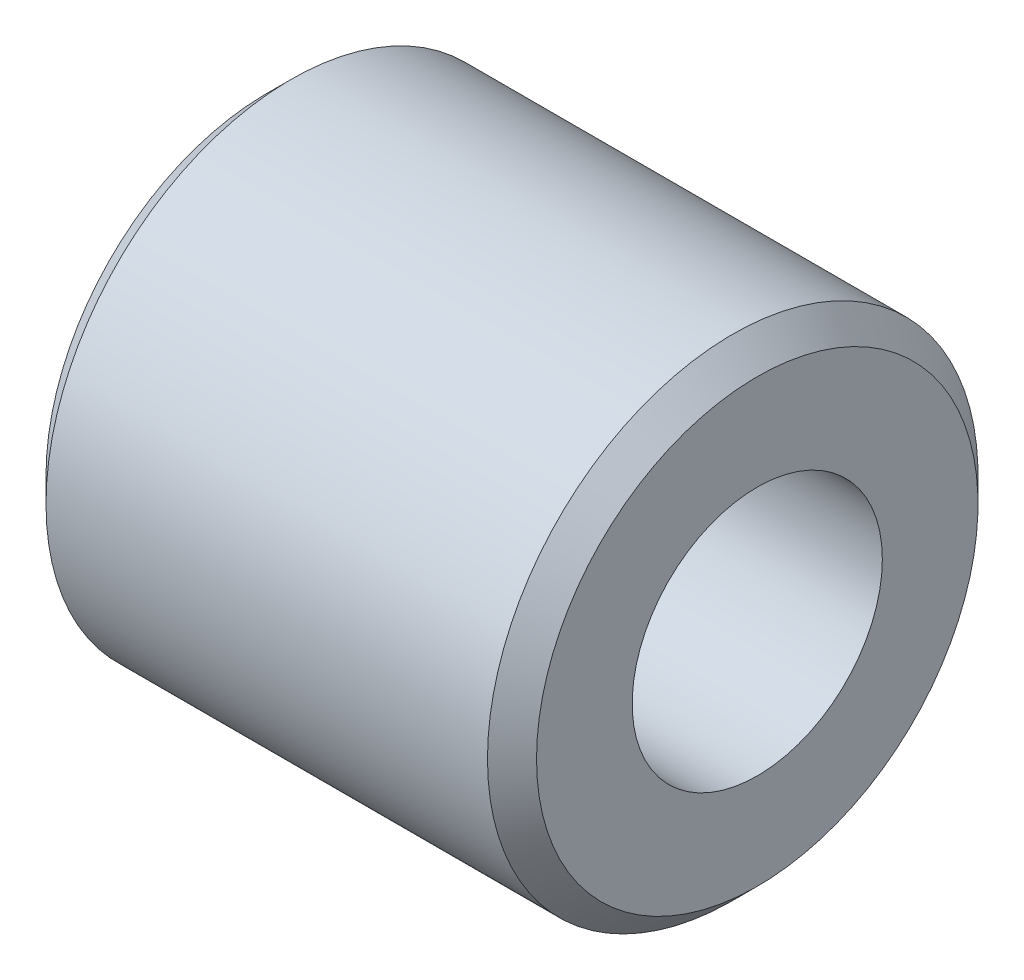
ISO-10303-21;
HEADER;
FILE_DESCRIPTION(('STEP AP214'),'2;1');
FILE_NAME('part.step','',(''),(''),'','','');
FILE_SCHEMA(('AUTOMOTIVE_DESIGN { 1 0 10303 214 1 1 1 1 }'));
ENDSEC;
DATA;
#1=APPLICATION_CONTEXT('core data for automotive mechanical design processes');
#2=APPLICATION_PROTOCOL_DEFINITION('international standard','automotive_design',2000,#1);
#3=PRODUCT_CONTEXT('',#1,'mechanical');
#4=PRODUCT('Part','Part','',(#3));
#5=PRODUCT_RELATED_PRODUCT_CATEGORY('part','',(#4));
#6=PRODUCT_DEFINITION_FORMATION('','',#4);
#7=PRODUCT_DEFINITION_CONTEXT('part definition',#1,'design');
#8=PRODUCT_DEFINITION('design','',#6,#7);
#9=PRODUCT_DEFINITION_SHAPE('','',#8);
#10=(LENGTH_UNIT() NAMED_UNIT(*) SI_UNIT(.MILLI.,.METRE.));
#11=(NAMED_UNIT(*) PLANE_ANGLE_UNIT() SI_UNIT($,.RADIAN.));
#12=(NAMED_UNIT(*) SI_UNIT($,.STERADIAN.) SOLID_ANGLE_UNIT());
#13=UNCERTAINTY_MEASURE_WITH_UNIT(LENGTH_MEASURE(1.E-05),#10,'distance_accuracy_value','');
#14=(GEOMETRIC_REPRESENTATION_CONTEXT(3) GLOBAL_UNCERTAINTY_ASSIGNED_CONTEXT((#13)) GLOBAL_UNIT_ASSIGNED_CONTEXT((#10,
#11,#12)) REPRESENTATION_CONTEXT('',''));
#15=CARTESIAN_POINT('',(0.,0.,0.));
#16=DIRECTION('',(0.,0.,1.));
#17=DIRECTION('',(1.,0.,0.));
#18=AXIS2_PLACEMENT_3D('',#15,#16,#17);
#19=CARTESIAN_POINT('',(0.,9.00000000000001,0.));
#20=DIRECTION('',(-1.,0.,0.));
#21=DIRECTION('',(0.,0.,1.));
#22=AXIS2_PLACEMENT_3D('',#19,#20,#21);
#23=PLANE('',#22);
#24=CARTESIAN_POINT('',(0.,0.,0.));
#25=DIRECTION('',(1.,0.,0.));
#26=DIRECTION('',(0.,0.,-1.));
#27=AXIS2_PLACEMENT_3D('',#24,#25,#26);
#28=CIRCLE('',#27,5.09999999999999);
#29=CARTESIAN_POINT('',(0.,0.,-5.09999999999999));
#30=VERTEX_POINT('',#29);
#31=EDGE_CURVE('E53',#30,#30,#28,.T.);
#32=ORIENTED_EDGE('',*,*,#31,.F.);
#33=EDGE_LOOP('',(#32));
#34=FACE_BOUND('',#33,.T.);
#35=CARTESIAN_POINT('',(0.,0.,0.));
#36=DIRECTION('',(-1.,0.,0.));
#37=DIRECTION('',(0.,0.,1.));
#38=AXIS2_PLACEMENT_3D('',#35,#36,#37);
#39=CIRCLE('',#38,9.00000000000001);
#40=CARTESIAN_POINT('',(0.,0.,9.00000000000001));
#41=VERTEX_POINT('',#40);
#42=EDGE_CURVE('E48',#41,#41,#39,.T.);
#43=ORIENTED_EDGE('',*,*,#42,.F.);
#44=EDGE_LOOP('',(#43));
#45=FACE_BOUND('',#44,.T.);
#46=ADVANCED_FACE('F34',(#34,#45),#23,.F.);
#47=CARTESIAN_POINT('',(-20.,0.,0.));
#48=DIRECTION('',(1.,0.,0.));
#49=DIRECTION('',(0.,0.,-1.));
#50=AXIS2_PLACEMENT_3D('',#47,#48,#49);
#51=PLANE('',#50);
#52=CARTESIAN_POINT('',(-20.,0.,0.));
#53=DIRECTION('',(1.,0.,0.));
#54=DIRECTION('',(0.,0.,-1.));
#55=AXIS2_PLACEMENT_3D('',#52,#53,#54);
#56=CIRCLE('',#55,5.09999999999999);
#57=CARTESIAN_POINT('',(-20.,0.,-5.09999999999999));
#58=VERTEX_POINT('',#57);
#59=EDGE_CURVE('E56',#58,#58,#56,.T.);
#60=ORIENTED_EDGE('',*,*,#59,.T.);
#61=EDGE_LOOP('',(#60));
#62=FACE_BOUND('',#61,.T.);
#63=CARTESIAN_POINT('',(-20.,0.,0.));
#64=DIRECTION('',(-1.,0.,0.));
#65=DIRECTION('',(0.,0.,1.));
#66=AXIS2_PLACEMENT_3D('',#63,#64,#65);
#67=CIRCLE('',#66,9.00000000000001);
#68=CARTESIAN_POINT('',(-20.,0.,9.00000000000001));
#69=VERTEX_POINT('',#68);
#70=EDGE_CURVE('E10',#69,#69,#67,.T.);
#71=ORIENTED_EDGE('',*,*,#70,.T.);
#72=EDGE_LOOP('',(#71));
#73=FACE_BOUND('',#72,.T.);
#74=ADVANCED_FACE('F60',(#62,#73),#51,.F.);
#75=CARTESIAN_POINT('',(-19.,0.,0.));
#76=DIRECTION('',(1.,0.,0.));
#77=DIRECTION('',(0.,0.,-1.));
#78=AXIS2_PLACEMENT_3D('',#75,#76,#77);
#79=CONICAL_SURFACE('',#78,10.,0.785398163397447);
#80=ORIENTED_EDGE('',*,*,#70,.F.);
#81=EDGE_LOOP('',(#80));
#82=FACE_BOUND('',#81,.T.);
#83=CARTESIAN_POINT('',(-19.,0.,0.));
#84=DIRECTION('',(-1.,0.,0.));
#85=DIRECTION('',(0.,0.,1.));
#86=AXIS2_PLACEMENT_3D('',#83,#84,#85);
#87=CIRCLE('',#86,10.);
#88=CARTESIAN_POINT('',(-19.,0.,10.));
#89=VERTEX_POINT('',#88);
#90=EDGE_CURVE('E40',#89,#89,#87,.T.);
#91=ORIENTED_EDGE('',*,*,#90,.T.);
#92=EDGE_LOOP('',(#91));
#93=FACE_BOUND('',#92,.T.);
#94=ADVANCED_FACE('F80',(#82,#93),#79,.T.);
#95=CARTESIAN_POINT('',(-22.0390516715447,0.,0.));
#96=DIRECTION('',(-1.,0.,0.));
#97=DIRECTION('',(0.,0.,1.));
#98=AXIS2_PLACEMENT_3D('',#95,#96,#97);
#99=CYLINDRICAL_SURFACE('',#98,10.);
#100=ORIENTED_EDGE('',*,*,#90,.F.);
#101=EDGE_LOOP('',(#100));
#102=FACE_BOUND('',#101,.T.);
#103=CARTESIAN_POINT('',(-1.,0.,0.));
#104=DIRECTION('',(-1.,0.,0.));
#105=DIRECTION('',(0.,0.,1.));
#106=AXIS2_PLACEMENT_3D('',#103,#104,#105);
#107=CIRCLE('',#106,10.);
#108=CARTESIAN_POINT('',(-1.,0.,10.));
#109=VERTEX_POINT('',#108);
#110=EDGE_CURVE('E44',#109,#109,#107,.T.);
#111=ORIENTED_EDGE('',*,*,#110,.T.);
#112=EDGE_LOOP('',(#111));
#113=FACE_BOUND('',#112,.T.);
#114=ADVANCED_FACE('F74',(#102,#113),#99,.T.);
#115=CARTESIAN_POINT('',(0.,0.,0.));
#116=DIRECTION('',(-1.,0.,0.));
#117=DIRECTION('',(0.,0.,1.));
#118=AXIS2_PLACEMENT_3D('',#115,#116,#117);
#119=CONICAL_SURFACE('',#118,9.00000000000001,0.785398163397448);
#120=ORIENTED_EDGE('',*,*,#110,.F.);
#121=EDGE_LOOP('',(#120));
#122=FACE_BOUND('',#121,.T.);
#123=ORIENTED_EDGE('',*,*,#42,.T.);
#124=EDGE_LOOP('',(#123));
#125=FACE_BOUND('',#124,.T.);
#126=ADVANCED_FACE('F65',(#122,#125),#119,.T.);
#127=CARTESIAN_POINT('',(0.,0.,0.));
#128=DIRECTION('',(1.,0.,0.));
#129=DIRECTION('',(0.,0.,-1.));
#130=AXIS2_PLACEMENT_3D('',#127,#128,#129);
#131=CYLINDRICAL_SURFACE('',#130,5.09999999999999);
#132=ORIENTED_EDGE('',*,*,#59,.F.);
#133=EDGE_LOOP('',(#132));
#134=FACE_BOUND('',#133,.T.);
#135=ORIENTED_EDGE('',*,*,#31,.T.);
#136=EDGE_LOOP('',(#135));
#137=FACE_BOUND('',#136,.T.);
#138=ADVANCED_FACE('F62',(#134,#137),#131,.F.);
#139=CLOSED_SHELL('',(#46,#74,#94,#114,#126,#138));
#140=MANIFOLD_SOLID_BREP('B2',#139);
#141=ADVANCED_BREP_SHAPE_REPRESENTATION('',(#18,#140),#14);
#142=SHAPE_DEFINITION_REPRESENTATION(#9,#141);
ENDSEC;
END-ISO-10303-21;
